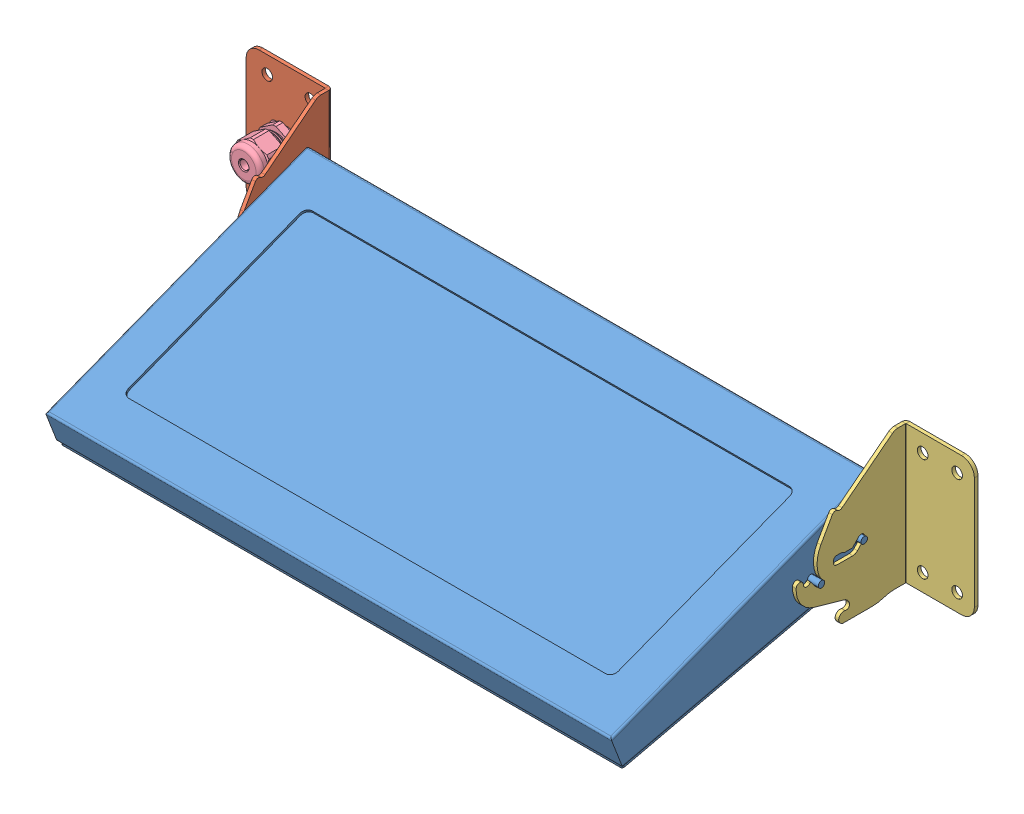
SolidWorks assembly Wall Mount Folding Keyboard, KB-xx-WMT.SLDASM, configuration Low Typing Position (file format 10000). Lengths in mm.
Overall size (536.19 148.76 222.31).
4 component instances, 4 part files, 15 mates.
Components (placement in the parent):
- Keyboard Enclosure, KB-xx-WMT-1: Keyboard Enclosure, KB-xx-WMT.SLDPRT [Default] at (-5.6676 34.7826 21.3615) x (1 0 0) z (0 -0.358693 0.933456) size (434.01 54.04 206.45)
- Bracket, 10755-1: Bracket, 10755.SLDPRT [Default] at (-219.3984 8.159 0) x (0 0 1) z (-1 0 0) size (83.5 104.28 60.96)
- Bracket, 10756-1: Bracket, 10756.SLDPRT [Default] at (205.4064 8.159 0) x (0 0 1) z (-1 0 0) size (83.5 104.28 53.09)
- Fitting, 30411 -1: Fitting, 30411 .SLDPRT [Default] at (-251.0316 8.159 -7.7572) x (0 0 -1) z (0.89763 -0.440749 0) size (39.13 26.54 26.55)
Mates (geometry in assembly coordinates):
- Coincident5: coincident aligned: plane of Bracket, 10755-1 through (-268.1766 49.4392 0) normal (0 0 -1); plane of Bracket, 10756-1 through (248.9674 -33.1212 0) normal (0 0 -1)
- Distance1: distance = 536.194 mm anti-aligned: plane of Bracket, 10756-1 through (258.4924 -33.1212 0) normal (1 0 0); plane of Bracket, 10755-1 through (-277.7016 49.4392 0) normal (-1 0 0)
- Coincident6: coincident aligned: plane of Bracket, 10755-1 through (-219.3984 58.9642 0) normal (0 1 0); plane of Bracket, 10756-1 through (248.9674 58.9642 0) normal (0 1 0)
- Width1: width aligned: plane of Bracket, 10756-1 through (205.4064 1.9111 45.2107) normal (-1 0 0); plane of Bracket, 10755-1 through (-216.7416 30.6155 51.3611) normal (1 0 0); plane of Keyboard Enclosure, KB-xx-WMT-1 through (-215.4716 2.2902 35.8145) normal (-1 0 0); plane of Keyboard Enclosure, KB-xx-WMT-1 through (204.1364 2.2902 35.8145) normal (1 0 0)
- Coincident7: coincident anti-aligned: plane of Bracket, 10756-1 through (248.9674 -33.1212 0) normal (0 0 -1); plane of assembly through (0 0 0) normal (0 0 1)
- Concentric16: concentric aligned: cylinder of Bracket, 10755-1 through (-251.0316 8.159 0) axis (0 0 1) radius 10.2108; cylinder of Fitting, 30411 -1 through (-251.0316 8.159 -8.0207) axis (0 0 1) radius 3.302
- Coincident8: coincident anti-aligned: plane of Bracket, 10755-1 through (-268.1766 49.4392 2.6568) normal (0 0 1); plane of Fitting, 30411 -1 through (-251.0316 8.159 2.6568) normal (0 0 -1)
- Concentric17: concentric aligned: cylinder of Keyboard Enclosure, KB-xx-WMT-1 through (210.5372 -6.2018 75.6147) axis (-1 0 0) radius 2.3876; cylinder of Bracket, 10756-1 through (208.0633 -6.2018 75.6147) axis (-1 0 0) radius 2.5781
- Tangent2: tangent anti-aligned: plane of Bracket, 10756-1 through (208.0633 -0.7332 41.97) normal (0 -1 0); cylinder of Keyboard Enclosure, KB-xx-WMT-1 through (210.5372 -3.1462 41.9702) axis (-1 0 0) radius 2.413
- Concentric21: concentric aligned: cylinder of Keyboard Enclosure, KB-xx-WMT-1 through (210.5372 -10.0642 67.2574) axis (-1 0 0) radius 2.3876; cylinder of Bracket, 10756-1 through (208.0633 -10.0642 67.2574) axis (-1 0 0) radius 2.5908
- Concentric19: concentric aligned: cylinder of Keyboard Enclosure, KB-xx-WMT-1 through (210.5372 30.6155 51.3611) axis (-1 0 0) radius 2.3876; cylinder of Bracket, 10756-1 through (208.0633 30.6155 51.3611) axis (-1 0 0) radius 2.5781
- Tangent6: tangent anti-aligned: cylinder of Keyboard Enclosure, KB-xx-WMT-1 through (210.5372 -3.0897 53.6516) axis (-1 0 0) radius 2.413; plane of Bracket, 10756-1 through (208.0633 -3.3113 56.0646) normal (0 0 -1)
- Concentric20: concentric: cylinder of Keyboard Enclosure, KB-xx-WMT-1 through (210.5372 -35.5302 46.6477) axis (-1 0 0) radius 2.3876; cylinder of Bracket, 10756-1 through (208.0633 -35.5302 46.6477) axis (-1 0 0) radius 2.5908
- Tangent9: tangent anti-aligned: cylinder of Keyboard Enclosure, KB-xx-WMT-1 through (210.5372 -2.1302 51.7204) axis (-1 0 0) radius 2.413; plane of Bracket, 10756-1 through (208.0633 0.2828 53.4865) normal (0 -1 0)
- Tangent10: tangent anti-aligned: cylinder of Keyboard Enclosure, KB-xx-WMT-1 through (210.5372 2.2902 35.8145) axis (-1 0 0) radius 2.413; plane of Bracket, 10756-1 through (208.0633 -0.7332 41.97) normal (0 -0.685057 -0.728489)
